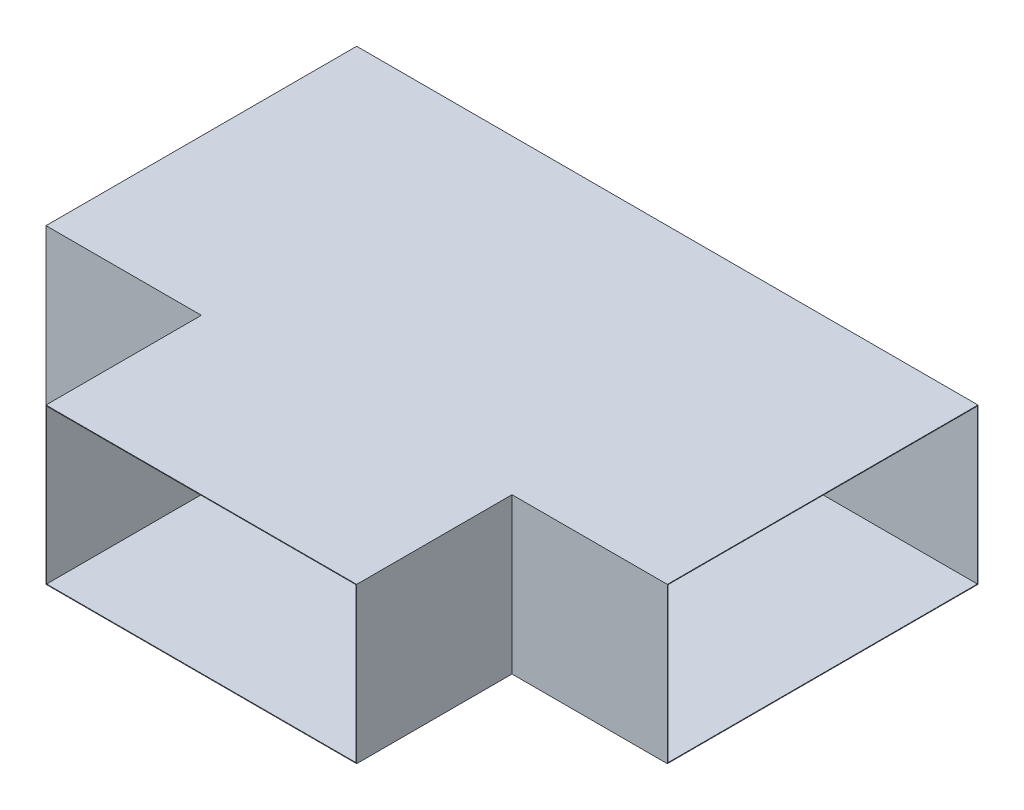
ISO-10303-21;
HEADER;
FILE_DESCRIPTION(('STEP AP214'),'2;1');
FILE_NAME('part.step','',(''),(''),'','','');
FILE_SCHEMA(('AUTOMOTIVE_DESIGN { 1 0 10303 214 1 1 1 1 }'));
ENDSEC;
DATA;
#1=APPLICATION_CONTEXT('core data for automotive mechanical design processes');
#2=APPLICATION_PROTOCOL_DEFINITION('international standard','automotive_design',2000,#1);
#3=PRODUCT_CONTEXT('',#1,'mechanical');
#4=PRODUCT('Part','Part','',(#3));
#5=PRODUCT_RELATED_PRODUCT_CATEGORY('part','',(#4));
#6=PRODUCT_DEFINITION_FORMATION('','',#4);
#7=PRODUCT_DEFINITION_CONTEXT('part definition',#1,'design');
#8=PRODUCT_DEFINITION('design','',#6,#7);
#9=PRODUCT_DEFINITION_SHAPE('','',#8);
#10=(LENGTH_UNIT() NAMED_UNIT(*) SI_UNIT(.MILLI.,.METRE.));
#11=(NAMED_UNIT(*) PLANE_ANGLE_UNIT() SI_UNIT($,.RADIAN.));
#12=(NAMED_UNIT(*) SI_UNIT($,.STERADIAN.) SOLID_ANGLE_UNIT());
#13=UNCERTAINTY_MEASURE_WITH_UNIT(LENGTH_MEASURE(1.E-05),#10,'distance_accuracy_value','');
#14=(GEOMETRIC_REPRESENTATION_CONTEXT(3) GLOBAL_UNCERTAINTY_ASSIGNED_CONTEXT((#13)) GLOBAL_UNIT_ASSIGNED_CONTEXT((#10,
#11,#12)) REPRESENTATION_CONTEXT('',''));
#15=CARTESIAN_POINT('',(0.,0.,0.));
#16=DIRECTION('',(0.,0.,1.));
#17=DIRECTION('',(1.,0.,0.));
#18=AXIS2_PLACEMENT_3D('',#15,#16,#17);
#19=CARTESIAN_POINT('',(1000.,250.,498.));
#20=DIRECTION('',(0.,0.,-1.));
#21=DIRECTION('',(0.,1.,0.));
#22=AXIS2_PLACEMENT_3D('',#19,#20,#21);
#23=PLANE('',#22);
#24=DIRECTION('',(-1.,0.,0.));
#25=VECTOR('',#24,1.);
#26=CARTESIAN_POINT('',(1000.,-248.,498.));
#27=LINE('',#26,#25);
#28=CARTESIAN_POINT('',(1000.,-248.,498.));
#29=VERTEX_POINT('',#28);
#30=CARTESIAN_POINT('',(498.,-248.,498.));
#31=VERTEX_POINT('',#30);
#32=EDGE_CURVE('E221',#29,#31,#27,.T.);
#33=ORIENTED_EDGE('',*,*,#32,.T.);
#34=DIRECTION('',(0.,-1.,0.));
#35=VECTOR('',#34,1.);
#36=CARTESIAN_POINT('',(498.,248.,498.));
#37=LINE('',#36,#35);
#38=CARTESIAN_POINT('',(498.,248.,498.));
#39=VERTEX_POINT('',#38);
#40=EDGE_CURVE('E215',#39,#31,#37,.T.);
#41=ORIENTED_EDGE('',*,*,#40,.F.);
#42=DIRECTION('',(-1.,0.,0.));
#43=VECTOR('',#42,1.);
#44=CARTESIAN_POINT('',(1000.,248.,498.));
#45=LINE('',#44,#43);
#46=CARTESIAN_POINT('',(1000.,248.,498.));
#47=VERTEX_POINT('',#46);
#48=EDGE_CURVE('E511',#47,#39,#45,.T.);
#49=ORIENTED_EDGE('',*,*,#48,.F.);
#50=DIRECTION('',(0.,-1.,0.));
#51=VECTOR('',#50,1.);
#52=CARTESIAN_POINT('',(1000.,250.,498.));
#53=LINE('',#52,#51);
#54=EDGE_CURVE('E523',#47,#29,#53,.T.);
#55=ORIENTED_EDGE('',*,*,#54,.T.);
#56=EDGE_LOOP('',(#33,#41,#49,#55));
#57=FACE_BOUND('',#56,.T.);
#58=ADVANCED_FACE('F80',(#57),#23,.T.);
#59=CARTESIAN_POINT('',(-498.,248.,498.));
#60=VERTEX_POINT('',#59);
#61=CARTESIAN_POINT('',(-1000.,248.,498.));
#62=VERTEX_POINT('',#61);
#63=EDGE_CURVE('E214',#60,#62,#45,.T.);
#64=ORIENTED_EDGE('',*,*,#63,.F.);
#65=DIRECTION('',(0.,1.,0.));
#66=VECTOR('',#65,1.);
#67=CARTESIAN_POINT('',(-498.,-248.,498.));
#68=LINE('',#67,#66);
#69=CARTESIAN_POINT('',(-498.,-248.,498.));
#70=VERTEX_POINT('',#69);
#71=EDGE_CURVE('E198',#70,#60,#68,.T.);
#72=ORIENTED_EDGE('',*,*,#71,.F.);
#73=CARTESIAN_POINT('',(-1000.,-248.,498.));
#74=VERTEX_POINT('',#73);
#75=EDGE_CURVE('E212',#70,#74,#27,.T.);
#76=ORIENTED_EDGE('',*,*,#75,.T.);
#77=DIRECTION('',(0.,-1.,0.));
#78=VECTOR('',#77,1.);
#79=CARTESIAN_POINT('',(-1000.,250.,498.));
#80=LINE('',#79,#78);
#81=EDGE_CURVE('E321',#62,#74,#80,.T.);
#82=ORIENTED_EDGE('',*,*,#81,.F.);
#83=EDGE_LOOP('',(#64,#72,#76,#82));
#84=FACE_BOUND('',#83,.T.);
#85=ADVANCED_FACE('F210',(#84),#23,.T.);
#86=CARTESIAN_POINT('',(1000.,250.,500.));
#87=DIRECTION('',(0.,0.,-1.));
#88=DIRECTION('',(0.,1.,0.));
#89=AXIS2_PLACEMENT_3D('',#86,#87,#88);
#90=PLANE('',#89);
#91=DIRECTION('',(-1.,0.,0.));
#92=VECTOR('',#91,1.);
#93=CARTESIAN_POINT('',(1000.,-250.,500.));
#94=LINE('',#93,#92);
#95=CARTESIAN_POINT('',(-500.,-250.,500.));
#96=VERTEX_POINT('',#95);
#97=CARTESIAN_POINT('',(-1000.,-250.,500.));
#98=VERTEX_POINT('',#97);
#99=EDGE_CURVE('E89',#96,#98,#94,.T.);
#100=ORIENTED_EDGE('',*,*,#99,.F.);
#101=DIRECTION('',(0.,1.,0.));
#102=VECTOR('',#101,1.);
#103=CARTESIAN_POINT('',(-500.,-250.,500.));
#104=LINE('',#103,#102);
#105=CARTESIAN_POINT('',(-500.,250.,500.));
#106=VERTEX_POINT('',#105);
#107=EDGE_CURVE('E206',#96,#106,#104,.T.);
#108=ORIENTED_EDGE('',*,*,#107,.T.);
#109=DIRECTION('',(-1.,0.,0.));
#110=VECTOR('',#109,1.);
#111=CARTESIAN_POINT('',(1000.,250.,500.));
#112=LINE('',#111,#110);
#113=CARTESIAN_POINT('',(-1000.,250.,500.));
#114=VERTEX_POINT('',#113);
#115=EDGE_CURVE('E240',#106,#114,#112,.T.);
#116=ORIENTED_EDGE('',*,*,#115,.T.);
#117=DIRECTION('',(0.,-1.,0.));
#118=VECTOR('',#117,1.);
#119=CARTESIAN_POINT('',(-1000.,250.,500.));
#120=LINE('',#119,#118);
#121=EDGE_CURVE('E225',#114,#98,#120,.T.);
#122=ORIENTED_EDGE('',*,*,#121,.T.);
#123=EDGE_LOOP('',(#100,#108,#116,#122));
#124=FACE_BOUND('',#123,.T.);
#125=ADVANCED_FACE('F284',(#124),#90,.F.);
#126=CARTESIAN_POINT('',(1000.,0.,0.));
#127=DIRECTION('',(1.,0.,0.));
#128=DIRECTION('',(0.,0.,-1.));
#129=AXIS2_PLACEMENT_3D('',#126,#127,#128);
#130=PLANE('',#129);
#131=DIRECTION('',(0.,-1.,0.));
#132=VECTOR('',#131,1.);
#133=CARTESIAN_POINT('',(1000.,250.,500.));
#134=LINE('',#133,#132);
#135=CARTESIAN_POINT('',(1000.,250.,500.));
#136=VERTEX_POINT('',#135);
#137=CARTESIAN_POINT('',(1000.,-250.,500.));
#138=VERTEX_POINT('',#137);
#139=EDGE_CURVE('E230',#136,#138,#134,.T.);
#140=ORIENTED_EDGE('',*,*,#139,.T.);
#141=DIRECTION('',(0.,0.,-1.));
#142=VECTOR('',#141,1.);
#143=CARTESIAN_POINT('',(1000.,-250.,500.));
#144=LINE('',#143,#142);
#145=CARTESIAN_POINT('',(1000.,-250.,-500.));
#146=VERTEX_POINT('',#145);
#147=EDGE_CURVE('E233',#138,#146,#144,.T.);
#148=ORIENTED_EDGE('',*,*,#147,.T.);
#149=DIRECTION('',(0.,1.,0.));
#150=VECTOR('',#149,1.);
#151=CARTESIAN_POINT('',(1000.,250.,-500.));
#152=LINE('',#151,#150);
#153=CARTESIAN_POINT('',(1000.,250.,-500.));
#154=VERTEX_POINT('',#153);
#155=EDGE_CURVE('E236',#146,#154,#152,.T.);
#156=ORIENTED_EDGE('',*,*,#155,.T.);
#157=DIRECTION('',(0.,0.,1.));
#158=VECTOR('',#157,1.);
#159=CARTESIAN_POINT('',(1000.,250.,500.));
#160=LINE('',#159,#158);
#161=EDGE_CURVE('E238',#154,#136,#160,.T.);
#162=ORIENTED_EDGE('',*,*,#161,.T.);
#163=EDGE_LOOP('',(#140,#148,#156,#162));
#164=FACE_BOUND('',#163,.T.);
#165=DIRECTION('',(0.,0.,-1.));
#166=VECTOR('',#165,1.);
#167=CARTESIAN_POINT('',(1000.,-248.,500.));
#168=LINE('',#167,#166);
#169=CARTESIAN_POINT('',(1000.,-248.,-498.));
#170=VERTEX_POINT('',#169);
#171=EDGE_CURVE('E532',#29,#170,#168,.T.);
#172=ORIENTED_EDGE('',*,*,#171,.F.);
#173=ORIENTED_EDGE('',*,*,#54,.F.);
#174=DIRECTION('',(0.,0.,1.));
#175=VECTOR('',#174,1.);
#176=CARTESIAN_POINT('',(1000.,248.,500.));
#177=LINE('',#176,#175);
#178=CARTESIAN_POINT('',(1000.,248.,-498.));
#179=VERTEX_POINT('',#178);
#180=EDGE_CURVE('E517',#179,#47,#177,.T.);
#181=ORIENTED_EDGE('',*,*,#180,.F.);
#182=DIRECTION('',(0.,1.,0.));
#183=VECTOR('',#182,1.);
#184=CARTESIAN_POINT('',(1000.,250.,-498.));
#185=LINE('',#184,#183);
#186=EDGE_CURVE('E529',#170,#179,#185,.T.);
#187=ORIENTED_EDGE('',*,*,#186,.F.);
#188=EDGE_LOOP('',(#172,#173,#181,#187));
#189=FACE_BOUND('',#188,.T.);
#190=ADVANCED_FACE('F335',(#164,#189),#130,.T.);
#191=CARTESIAN_POINT('',(-1000.,0.,0.));
#192=DIRECTION('',(1.,0.,0.));
#193=DIRECTION('',(0.,0.,-1.));
#194=AXIS2_PLACEMENT_3D('',#191,#192,#193);
#195=PLANE('',#194);
#196=ORIENTED_EDGE('',*,*,#121,.F.);
#197=DIRECTION('',(0.,0.,1.));
#198=VECTOR('',#197,1.);
#199=CARTESIAN_POINT('',(-1000.,250.,500.));
#200=LINE('',#199,#198);
#201=CARTESIAN_POINT('',(-1000.,250.,-500.));
#202=VERTEX_POINT('',#201);
#203=EDGE_CURVE('E234',#202,#114,#200,.T.);
#204=ORIENTED_EDGE('',*,*,#203,.F.);
#205=DIRECTION('',(0.,1.,0.));
#206=VECTOR('',#205,1.);
#207=CARTESIAN_POINT('',(-1000.,250.,-500.));
#208=LINE('',#207,#206);
#209=CARTESIAN_POINT('',(-1000.,-250.,-500.));
#210=VERTEX_POINT('',#209);
#211=EDGE_CURVE('E245',#210,#202,#208,.T.);
#212=ORIENTED_EDGE('',*,*,#211,.F.);
#213=DIRECTION('',(0.,0.,-1.));
#214=VECTOR('',#213,1.);
#215=CARTESIAN_POINT('',(-1000.,-250.,500.));
#216=LINE('',#215,#214);
#217=EDGE_CURVE('E243',#98,#210,#216,.T.);
#218=ORIENTED_EDGE('',*,*,#217,.F.);
#219=EDGE_LOOP('',(#196,#204,#212,#218));
#220=FACE_BOUND('',#219,.T.);
#221=ORIENTED_EDGE('',*,*,#81,.T.);
#222=DIRECTION('',(0.,0.,-1.));
#223=VECTOR('',#222,1.);
#224=CARTESIAN_POINT('',(-1000.,-248.,500.));
#225=LINE('',#224,#223);
#226=CARTESIAN_POINT('',(-1000.,-248.,-498.));
#227=VERTEX_POINT('',#226);
#228=EDGE_CURVE('E219',#74,#227,#225,.T.);
#229=ORIENTED_EDGE('',*,*,#228,.T.);
#230=DIRECTION('',(0.,1.,0.));
#231=VECTOR('',#230,1.);
#232=CARTESIAN_POINT('',(-1000.,250.,-498.));
#233=LINE('',#232,#231);
#234=CARTESIAN_POINT('',(-1000.,248.,-498.));
#235=VERTEX_POINT('',#234);
#236=EDGE_CURVE('E524',#227,#235,#233,.T.);
#237=ORIENTED_EDGE('',*,*,#236,.T.);
#238=DIRECTION('',(0.,0.,1.));
#239=VECTOR('',#238,1.);
#240=CARTESIAN_POINT('',(-1000.,248.,500.));
#241=LINE('',#240,#239);
#242=EDGE_CURVE('E520',#235,#62,#241,.T.);
#243=ORIENTED_EDGE('',*,*,#242,.T.);
#244=EDGE_LOOP('',(#221,#229,#237,#243));
#245=FACE_BOUND('',#244,.T.);
#246=ADVANCED_FACE('F279',(#220,#245),#195,.F.);
#247=CARTESIAN_POINT('',(500.,250.,500.));
#248=VERTEX_POINT('',#247);
#249=EDGE_CURVE('E257',#136,#248,#112,.T.);
#250=ORIENTED_EDGE('',*,*,#249,.T.);
#251=DIRECTION('',(0.,-1.,0.));
#252=VECTOR('',#251,1.);
#253=CARTESIAN_POINT('',(500.,-250.,500.));
#254=LINE('',#253,#252);
#255=CARTESIAN_POINT('',(500.,-250.,500.));
#256=VERTEX_POINT('',#255);
#257=EDGE_CURVE('E307',#248,#256,#254,.T.);
#258=ORIENTED_EDGE('',*,*,#257,.T.);
#259=EDGE_CURVE('E12',#138,#256,#94,.T.);
#260=ORIENTED_EDGE('',*,*,#259,.F.);
#261=ORIENTED_EDGE('',*,*,#139,.F.);
#262=EDGE_LOOP('',(#250,#258,#260,#261));
#263=FACE_BOUND('',#262,.T.);
#264=ADVANCED_FACE('F82',(#263),#90,.F.);
#265=CARTESIAN_POINT('',(1000.,-250.,500.));
#266=DIRECTION('',(0.,1.,0.));
#267=DIRECTION('',(0.,0.,1.));
#268=AXIS2_PLACEMENT_3D('',#265,#266,#267);
#269=PLANE('',#268);
#270=ORIENTED_EDGE('',*,*,#217,.T.);
#271=DIRECTION('',(-1.,0.,0.));
#272=VECTOR('',#271,1.);
#273=CARTESIAN_POINT('',(1000.,-250.,-500.));
#274=LINE('',#273,#272);
#275=EDGE_CURVE('E261',#146,#210,#274,.T.);
#276=ORIENTED_EDGE('',*,*,#275,.F.);
#277=ORIENTED_EDGE('',*,*,#147,.F.);
#278=ORIENTED_EDGE('',*,*,#259,.T.);
#279=DIRECTION('',(0.,0.,-1.));
#280=VECTOR('',#279,1.);
#281=CARTESIAN_POINT('',(500.,-250.,1000.));
#282=LINE('',#281,#280);
#283=CARTESIAN_POINT('',(500.,-250.,1000.));
#284=VERTEX_POINT('',#283);
#285=EDGE_CURVE('E105',#284,#256,#282,.T.);
#286=ORIENTED_EDGE('',*,*,#285,.F.);
#287=DIRECTION('',(-1.,0.,0.));
#288=VECTOR('',#287,1.);
#289=CARTESIAN_POINT('',(-500.,-250.,1000.));
#290=LINE('',#289,#288);
#291=CARTESIAN_POINT('',(-500.,-250.,1000.));
#292=VERTEX_POINT('',#291);
#293=EDGE_CURVE('E294',#284,#292,#290,.T.);
#294=ORIENTED_EDGE('',*,*,#293,.T.);
#295=DIRECTION('',(0.,0.,-1.));
#296=VECTOR('',#295,1.);
#297=CARTESIAN_POINT('',(-500.,-250.,1000.));
#298=LINE('',#297,#296);
#299=EDGE_CURVE('E306',#292,#96,#298,.T.);
#300=ORIENTED_EDGE('',*,*,#299,.T.);
#301=ORIENTED_EDGE('',*,*,#99,.T.);
#302=EDGE_LOOP('',(#270,#276,#277,#278,#286,#294,#300,#301));
#303=FACE_BOUND('',#302,.T.);
#304=ADVANCED_FACE('F339',(#303),#269,.F.);
#305=CARTESIAN_POINT('',(1000.,250.,-500.));
#306=DIRECTION('',(0.,0.,1.));
#307=DIRECTION('',(1.,0.,0.));
#308=AXIS2_PLACEMENT_3D('',#305,#306,#307);
#309=PLANE('',#308);
#310=ORIENTED_EDGE('',*,*,#211,.T.);
#311=DIRECTION('',(-1.,0.,0.));
#312=VECTOR('',#311,1.);
#313=CARTESIAN_POINT('',(1000.,250.,-500.));
#314=LINE('',#313,#312);
#315=EDGE_CURVE('E251',#154,#202,#314,.T.);
#316=ORIENTED_EDGE('',*,*,#315,.F.);
#317=ORIENTED_EDGE('',*,*,#155,.F.);
#318=ORIENTED_EDGE('',*,*,#275,.T.);
#319=EDGE_LOOP('',(#310,#316,#317,#318));
#320=FACE_BOUND('',#319,.T.);
#321=ADVANCED_FACE('F337',(#320),#309,.F.);
#322=CARTESIAN_POINT('',(1000.,250.,500.));
#323=DIRECTION('',(0.,-1.,0.));
#324=DIRECTION('',(0.,0.,-1.));
#325=AXIS2_PLACEMENT_3D('',#322,#323,#324);
#326=PLANE('',#325);
#327=ORIENTED_EDGE('',*,*,#203,.T.);
#328=ORIENTED_EDGE('',*,*,#115,.F.);
#329=DIRECTION('',(0.,0.,-1.));
#330=VECTOR('',#329,1.);
#331=CARTESIAN_POINT('',(-500.,250.,1000.));
#332=LINE('',#331,#330);
#333=CARTESIAN_POINT('',(-500.,250.,1000.));
#334=VERTEX_POINT('',#333);
#335=EDGE_CURVE('E288',#334,#106,#332,.T.);
#336=ORIENTED_EDGE('',*,*,#335,.F.);
#337=DIRECTION('',(1.,0.,0.));
#338=VECTOR('',#337,1.);
#339=CARTESIAN_POINT('',(-500.,250.,1000.));
#340=LINE('',#339,#338);
#341=CARTESIAN_POINT('',(500.,250.,1000.));
#342=VERTEX_POINT('',#341);
#343=EDGE_CURVE('E290',#334,#342,#340,.T.);
#344=ORIENTED_EDGE('',*,*,#343,.T.);
#345=DIRECTION('',(0.,0.,-1.));
#346=VECTOR('',#345,1.);
#347=CARTESIAN_POINT('',(500.,250.,1000.));
#348=LINE('',#347,#346);
#349=EDGE_CURVE('E293',#342,#248,#348,.T.);
#350=ORIENTED_EDGE('',*,*,#349,.T.);
#351=ORIENTED_EDGE('',*,*,#249,.F.);
#352=ORIENTED_EDGE('',*,*,#161,.F.);
#353=ORIENTED_EDGE('',*,*,#315,.T.);
#354=EDGE_LOOP('',(#327,#328,#336,#344,#350,#351,#352,#353));
#355=FACE_BOUND('',#354,.T.);
#356=ADVANCED_FACE('F274',(#355),#326,.F.);
#357=CARTESIAN_POINT('',(1000.,-248.,500.));
#358=DIRECTION('',(0.,1.,0.));
#359=DIRECTION('',(0.,0.,1.));
#360=AXIS2_PLACEMENT_3D('',#357,#358,#359);
#361=PLANE('',#360);
#362=ORIENTED_EDGE('',*,*,#228,.F.);
#363=ORIENTED_EDGE('',*,*,#75,.F.);
#364=DIRECTION('',(0.,0.,-1.));
#365=VECTOR('',#364,1.);
#366=CARTESIAN_POINT('',(-498.,-248.,1000.));
#367=LINE('',#366,#365);
#368=CARTESIAN_POINT('',(-498.,-248.,1000.));
#369=VERTEX_POINT('',#368);
#370=EDGE_CURVE('E195',#369,#70,#367,.T.);
#371=ORIENTED_EDGE('',*,*,#370,.F.);
#372=DIRECTION('',(-1.,0.,0.));
#373=VECTOR('',#372,1.);
#374=CARTESIAN_POINT('',(-500.,-248.,1000.));
#375=LINE('',#374,#373);
#376=CARTESIAN_POINT('',(498.,-248.,1000.));
#377=VERTEX_POINT('',#376);
#378=EDGE_CURVE('E537',#377,#369,#375,.T.);
#379=ORIENTED_EDGE('',*,*,#378,.F.);
#380=DIRECTION('',(0.,0.,-1.));
#381=VECTOR('',#380,1.);
#382=CARTESIAN_POINT('',(498.,-248.,1000.));
#383=LINE('',#382,#381);
#384=EDGE_CURVE('E207',#377,#31,#383,.T.);
#385=ORIENTED_EDGE('',*,*,#384,.T.);
#386=ORIENTED_EDGE('',*,*,#32,.F.);
#387=ORIENTED_EDGE('',*,*,#171,.T.);
#388=DIRECTION('',(-1.,0.,0.));
#389=VECTOR('',#388,1.);
#390=CARTESIAN_POINT('',(1000.,-248.,-498.));
#391=LINE('',#390,#389);
#392=EDGE_CURVE('E222',#170,#227,#391,.T.);
#393=ORIENTED_EDGE('',*,*,#392,.T.);
#394=EDGE_LOOP('',(#362,#363,#371,#379,#385,#386,#387,#393));
#395=FACE_BOUND('',#394,.T.);
#396=ADVANCED_FACE('F217',(#395),#361,.T.);
#397=CARTESIAN_POINT('',(1000.,250.,-498.));
#398=DIRECTION('',(0.,0.,1.));
#399=DIRECTION('',(1.,0.,0.));
#400=AXIS2_PLACEMENT_3D('',#397,#398,#399);
#401=PLANE('',#400);
#402=ORIENTED_EDGE('',*,*,#236,.F.);
#403=ORIENTED_EDGE('',*,*,#392,.F.);
#404=ORIENTED_EDGE('',*,*,#186,.T.);
#405=DIRECTION('',(-1.,0.,0.));
#406=VECTOR('',#405,1.);
#407=CARTESIAN_POINT('',(1000.,248.,-498.));
#408=LINE('',#407,#406);
#409=EDGE_CURVE('E226',#179,#235,#408,.T.);
#410=ORIENTED_EDGE('',*,*,#409,.T.);
#411=EDGE_LOOP('',(#402,#403,#404,#410));
#412=FACE_BOUND('',#411,.T.);
#413=ADVANCED_FACE('F388',(#412),#401,.T.);
#414=CARTESIAN_POINT('',(1000.,248.,500.));
#415=DIRECTION('',(0.,-1.,0.));
#416=DIRECTION('',(0.,0.,-1.));
#417=AXIS2_PLACEMENT_3D('',#414,#415,#416);
#418=PLANE('',#417);
#419=ORIENTED_EDGE('',*,*,#242,.F.);
#420=ORIENTED_EDGE('',*,*,#409,.F.);
#421=ORIENTED_EDGE('',*,*,#180,.T.);
#422=ORIENTED_EDGE('',*,*,#48,.T.);
#423=DIRECTION('',(0.,0.,-1.));
#424=VECTOR('',#423,1.);
#425=CARTESIAN_POINT('',(498.,248.,1000.));
#426=LINE('',#425,#424);
#427=CARTESIAN_POINT('',(498.,248.,1000.));
#428=VERTEX_POINT('',#427);
#429=EDGE_CURVE('E504',#428,#39,#426,.T.);
#430=ORIENTED_EDGE('',*,*,#429,.F.);
#431=DIRECTION('',(1.,0.,0.));
#432=VECTOR('',#431,1.);
#433=CARTESIAN_POINT('',(-500.,248.,1000.));
#434=LINE('',#433,#432);
#435=CARTESIAN_POINT('',(-498.,248.,1000.));
#436=VERTEX_POINT('',#435);
#437=EDGE_CURVE('E542',#436,#428,#434,.T.);
#438=ORIENTED_EDGE('',*,*,#437,.F.);
#439=DIRECTION('',(0.,0.,-1.));
#440=VECTOR('',#439,1.);
#441=CARTESIAN_POINT('',(-498.,248.,1000.));
#442=LINE('',#441,#440);
#443=EDGE_CURVE('E97',#436,#60,#442,.T.);
#444=ORIENTED_EDGE('',*,*,#443,.T.);
#445=ORIENTED_EDGE('',*,*,#63,.T.);
#446=EDGE_LOOP('',(#419,#420,#421,#422,#430,#438,#444,#445));
#447=FACE_BOUND('',#446,.T.);
#448=ADVANCED_FACE('F392',(#447),#418,.T.);
#449=CARTESIAN_POINT('',(-500.,-250.,1000.));
#450=DIRECTION('',(-1.,0.,0.));
#451=DIRECTION('',(0.,-1.,0.));
#452=AXIS2_PLACEMENT_3D('',#449,#450,#451);
#453=PLANE('',#452);
#454=ORIENTED_EDGE('',*,*,#107,.F.);
#455=ORIENTED_EDGE('',*,*,#299,.F.);
#456=DIRECTION('',(0.,1.,0.));
#457=VECTOR('',#456,1.);
#458=CARTESIAN_POINT('',(-500.,-250.,1000.));
#459=LINE('',#458,#457);
#460=EDGE_CURVE('E301',#292,#334,#459,.T.);
#461=ORIENTED_EDGE('',*,*,#460,.T.);
#462=ORIENTED_EDGE('',*,*,#335,.T.);
#463=EDGE_LOOP('',(#454,#455,#461,#462));
#464=FACE_BOUND('',#463,.T.);
#465=ADVANCED_FACE('F305',(#464),#453,.T.);
#466=CARTESIAN_POINT('',(500.,-250.,1000.));
#467=DIRECTION('',(1.,0.,0.));
#468=DIRECTION('',(0.,0.,-1.));
#469=AXIS2_PLACEMENT_3D('',#466,#467,#468);
#470=PLANE('',#469);
#471=ORIENTED_EDGE('',*,*,#257,.F.);
#472=ORIENTED_EDGE('',*,*,#349,.F.);
#473=DIRECTION('',(0.,-1.,0.));
#474=VECTOR('',#473,1.);
#475=CARTESIAN_POINT('',(500.,-250.,1000.));
#476=LINE('',#475,#474);
#477=EDGE_CURVE('E303',#342,#284,#476,.T.);
#478=ORIENTED_EDGE('',*,*,#477,.T.);
#479=ORIENTED_EDGE('',*,*,#285,.T.);
#480=EDGE_LOOP('',(#471,#472,#478,#479));
#481=FACE_BOUND('',#480,.T.);
#482=ADVANCED_FACE('F331',(#481),#470,.T.);
#483=CARTESIAN_POINT('',(0.,0.,1000.));
#484=DIRECTION('',(0.,0.,-1.));
#485=DIRECTION('',(-1.,0.,0.));
#486=AXIS2_PLACEMENT_3D('',#483,#484,#485);
#487=PLANE('',#486);
#488=ORIENTED_EDGE('',*,*,#378,.T.);
#489=DIRECTION('',(0.,1.,0.));
#490=VECTOR('',#489,1.);
#491=CARTESIAN_POINT('',(-498.,-250.,1000.));
#492=LINE('',#491,#490);
#493=EDGE_CURVE('E201',#369,#436,#492,.T.);
#494=ORIENTED_EDGE('',*,*,#493,.T.);
#495=ORIENTED_EDGE('',*,*,#437,.T.);
#496=DIRECTION('',(0.,-1.,0.));
#497=VECTOR('',#496,1.);
#498=CARTESIAN_POINT('',(498.,-250.,1000.));
#499=LINE('',#498,#497);
#500=EDGE_CURVE('E507',#428,#377,#499,.T.);
#501=ORIENTED_EDGE('',*,*,#500,.T.);
#502=EDGE_LOOP('',(#488,#494,#495,#501));
#503=FACE_BOUND('',#502,.T.);
#504=ORIENTED_EDGE('',*,*,#460,.F.);
#505=ORIENTED_EDGE('',*,*,#293,.F.);
#506=ORIENTED_EDGE('',*,*,#477,.F.);
#507=ORIENTED_EDGE('',*,*,#343,.F.);
#508=EDGE_LOOP('',(#504,#505,#506,#507));
#509=FACE_BOUND('',#508,.T.);
#510=ADVANCED_FACE('F299',(#503,#509),#487,.F.);
#511=CARTESIAN_POINT('',(-498.,-250.,1000.));
#512=DIRECTION('',(-1.,0.,0.));
#513=DIRECTION('',(0.,-1.,0.));
#514=AXIS2_PLACEMENT_3D('',#511,#512,#513);
#515=PLANE('',#514);
#516=ORIENTED_EDGE('',*,*,#370,.T.);
#517=ORIENTED_EDGE('',*,*,#71,.T.);
#518=ORIENTED_EDGE('',*,*,#443,.F.);
#519=ORIENTED_EDGE('',*,*,#493,.F.);
#520=EDGE_LOOP('',(#516,#517,#518,#519));
#521=FACE_BOUND('',#520,.T.);
#522=ADVANCED_FACE('F197',(#521),#515,.F.);
#523=CARTESIAN_POINT('',(498.,-250.,1000.));
#524=DIRECTION('',(1.,0.,0.));
#525=DIRECTION('',(0.,0.,-1.));
#526=AXIS2_PLACEMENT_3D('',#523,#524,#525);
#527=PLANE('',#526);
#528=ORIENTED_EDGE('',*,*,#429,.T.);
#529=ORIENTED_EDGE('',*,*,#40,.T.);
#530=ORIENTED_EDGE('',*,*,#384,.F.);
#531=ORIENTED_EDGE('',*,*,#500,.F.);
#532=EDGE_LOOP('',(#528,#529,#530,#531));
#533=FACE_BOUND('',#532,.T.);
#534=ADVANCED_FACE('F432',(#533),#527,.F.);
#535=CLOSED_SHELL('',(#58,#85,#125,#190,#246,#264,#304,#321,#356,#396,#413,#448,#465,#482,#510,
#522,#534));
#536=MANIFOLD_SOLID_BREP('B2',#535);
#537=ADVANCED_BREP_SHAPE_REPRESENTATION('',(#18,#536),#14);
#538=SHAPE_DEFINITION_REPRESENTATION(#9,#537);
ENDSEC;
END-ISO-10303-21;
